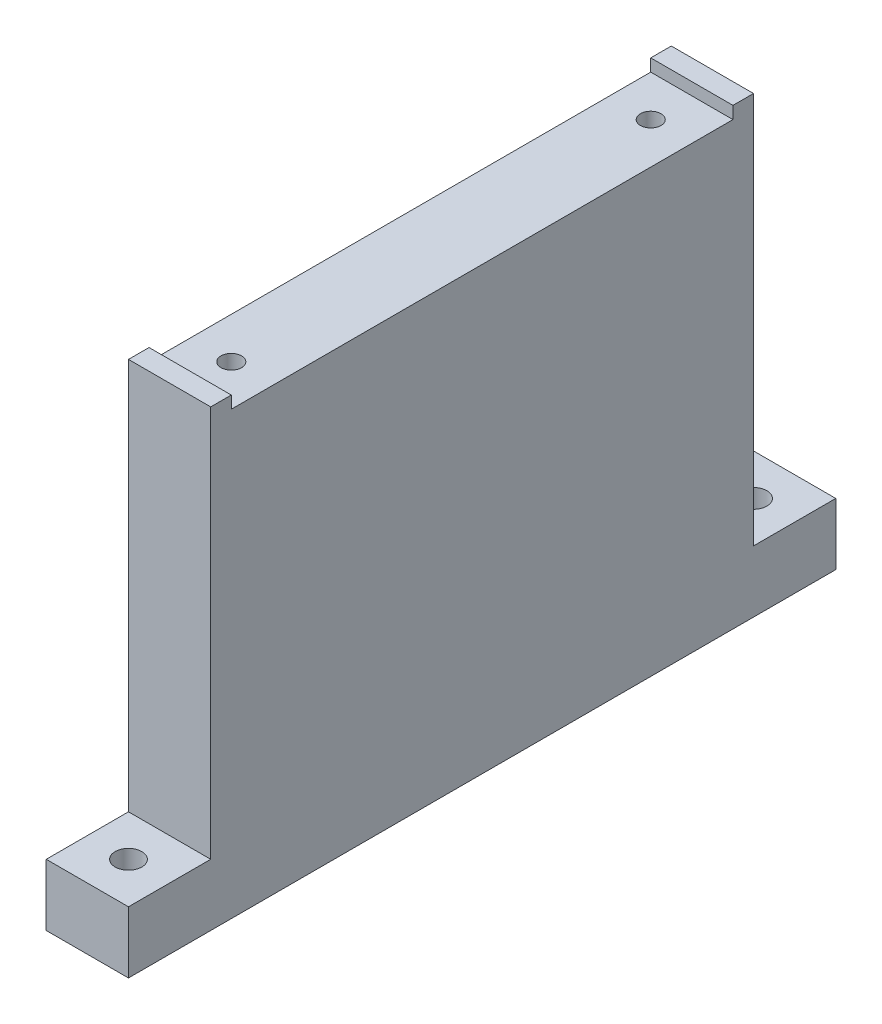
from build123d import *

# Parameters (mm, degrees)
SKETCH_1_W          = 20
SKETCH_1_H          = 110.280000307
EXTRUDE_1_DEPTH     = 172
SKETCH_2_OUTSIDE_W  = 215.058
SKETCH_2_OUTSIDE_H  = 153.338
CUT_EXTRUDE_1_DEPTH = 172
SKETCH_3_R          = 3.25
CUT_EXTRUDE_2_DEPTH = 172
SKETCH_4_R          = 2.5
CUT_EXTRUDE_3_DEPTH = 25


with BuildPart() as part:
    # Sketch 1 → Extrude 1 (new body)
    with BuildSketch(Plane.XY):
        with Locations((10, 55.140000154)):
            Rectangle(SKETCH_1_W, SKETCH_1_H)
    extrude(amount=EXTRUDE_1_DEPTH)

    # Sketch 2 outside → Cut-Extrude 1 (cut)
    with BuildSketch(Plane(origin=(20, 0, 0), x_dir=(0, 0, -1), z_dir=(1, 0, 0))):
        with Locations((-86, 55.14)):
            Rectangle(SKETCH_2_OUTSIDE_W, SKETCH_2_OUTSIDE_H)
        Polygon((-25, 107.280000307), (-25, 110.280000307), (-20, 110.280000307), (-20, 15), (0, 15), (0, 0), (-172, 0), (-172, 15), (-152, 15), (-152, 110.280000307), (-147, 110.280000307), (-147, 107.280000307), align=None, mode=Mode.SUBTRACT)
    extrude(amount=-CUT_EXTRUDE_1_DEPTH, mode=Mode.SUBTRACT)

    # Sketch 3 → Cut-Extrude 2 (cut)
    with BuildSketch(Plane(origin=(0, 15, 0), x_dir=(1, 0, 0), z_dir=(0, 1, 0))):
        with Locations(Location((10, -10, 0), (0, 0, 270))):
            Circle(SKETCH_3_R)
        with Locations(Location((10, -162, 0), (0, 0, 270))):
            Circle(SKETCH_3_R)
    extrude(amount=-CUT_EXTRUDE_2_DEPTH, mode=Mode.SUBTRACT)

    # Sketch 4 → Cut-Extrude 3 (cut)
    with BuildSketch(Plane(origin=(0, 107.280000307, 0), x_dir=(1, 0, 0), z_dir=(0, 1, 0))):
        with Locations(Location((10, -35, 0), (0, 0, 270))):
            Circle(SKETCH_4_R)
        with Locations(Location((10, -137, 0), (0, 0, 270))):
            Circle(SKETCH_4_R)
    extrude(amount=-CUT_EXTRUDE_3_DEPTH, mode=Mode.SUBTRACT)


solid = part.part
